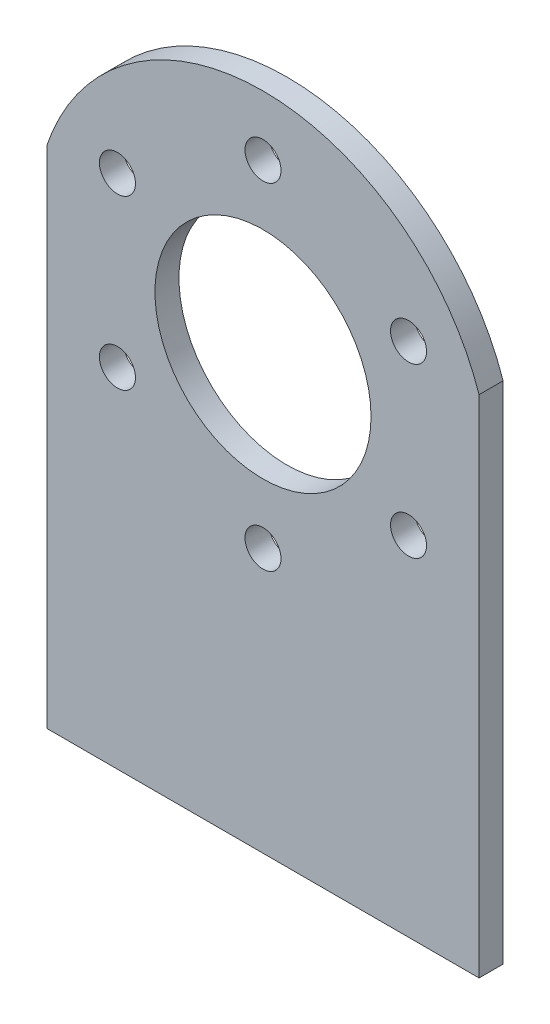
ISO-10303-21;
HEADER;
FILE_DESCRIPTION(('STEP AP214'),'2;1');
FILE_NAME('part.step','',(''),(''),'','','');
FILE_SCHEMA(('AUTOMOTIVE_DESIGN { 1 0 10303 214 1 1 1 1 }'));
ENDSEC;
DATA;
#1=APPLICATION_CONTEXT('core data for automotive mechanical design processes');
#2=APPLICATION_PROTOCOL_DEFINITION('international standard','automotive_design',2000,#1);
#3=PRODUCT_CONTEXT('',#1,'mechanical');
#4=PRODUCT('Part','Part','',(#3));
#5=PRODUCT_RELATED_PRODUCT_CATEGORY('part','',(#4));
#6=PRODUCT_DEFINITION_FORMATION('','',#4);
#7=PRODUCT_DEFINITION_CONTEXT('part definition',#1,'design');
#8=PRODUCT_DEFINITION('design','',#6,#7);
#9=PRODUCT_DEFINITION_SHAPE('','',#8);
#10=(LENGTH_UNIT() NAMED_UNIT(*) SI_UNIT(.MILLI.,.METRE.));
#11=(NAMED_UNIT(*) PLANE_ANGLE_UNIT() SI_UNIT($,.RADIAN.));
#12=(NAMED_UNIT(*) SI_UNIT($,.STERADIAN.) SOLID_ANGLE_UNIT());
#13=UNCERTAINTY_MEASURE_WITH_UNIT(LENGTH_MEASURE(1.E-05),#10,'distance_accuracy_value','');
#14=(GEOMETRIC_REPRESENTATION_CONTEXT(3) GLOBAL_UNCERTAINTY_ASSIGNED_CONTEXT((#13)) GLOBAL_UNIT_ASSIGNED_CONTEXT((#10,
#11,#12)) REPRESENTATION_CONTEXT('',''));
#15=CARTESIAN_POINT('',(0.,0.,0.));
#16=DIRECTION('',(0.,0.,1.));
#17=DIRECTION('',(1.,0.,0.));
#18=AXIS2_PLACEMENT_3D('',#15,#16,#17);
#19=CARTESIAN_POINT('',(-57.15,87.3125,-6.34999999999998));
#20=DIRECTION('',(1.,0.,0.));
#21=DIRECTION('',(0.,0.,-1.));
#22=AXIS2_PLACEMENT_3D('',#19,#20,#21);
#23=PLANE('',#22);
#24=DIRECTION('',(0.,-1.,0.));
#25=VECTOR('',#24,1.);
#26=CARTESIAN_POINT('',(-57.15,87.3125,0.));
#27=LINE('',#26,#25);
#28=CARTESIAN_POINT('',(-57.15,46.3002710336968,0.));
#29=VERTEX_POINT('',#28);
#30=CARTESIAN_POINT('',(-57.15,-87.3125,0.));
#31=VERTEX_POINT('',#30);
#32=EDGE_CURVE('E11',#29,#31,#27,.T.);
#33=ORIENTED_EDGE('',*,*,#32,.F.);
#34=DIRECTION('',(0.,0.,1.));
#35=VECTOR('',#34,1.);
#36=CARTESIAN_POINT('',(-57.15,46.3002710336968,-6.35));
#37=LINE('',#36,#35);
#38=CARTESIAN_POINT('',(-57.15,46.3002710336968,-6.35));
#39=VERTEX_POINT('',#38);
#40=EDGE_CURVE('E74',#39,#29,#37,.T.);
#41=ORIENTED_EDGE('',*,*,#40,.F.);
#42=DIRECTION('',(0.,-1.,0.));
#43=VECTOR('',#42,1.);
#44=CARTESIAN_POINT('',(-57.15,87.3125,-6.34999999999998));
#45=LINE('',#44,#43);
#46=CARTESIAN_POINT('',(-57.15,-87.3125,-6.34999999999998));
#47=VERTEX_POINT('',#46);
#48=EDGE_CURVE('E55',#39,#47,#45,.T.);
#49=ORIENTED_EDGE('',*,*,#48,.T.);
#50=DIRECTION('',(0.,0.,1.));
#51=VECTOR('',#50,1.);
#52=CARTESIAN_POINT('',(-57.15,-87.3125,-6.34999999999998));
#53=LINE('',#52,#51);
#54=EDGE_CURVE('E80',#47,#31,#53,.T.);
#55=ORIENTED_EDGE('',*,*,#54,.T.);
#56=EDGE_LOOP('',(#33,#41,#49,#55));
#57=FACE_BOUND('',#56,.T.);
#58=ADVANCED_FACE('F33',(#57),#23,.F.);
#59=CARTESIAN_POINT('',(-57.15,87.3125,0.));
#60=DIRECTION('',(0.,0.,-1.));
#61=DIRECTION('',(-1.,0.,0.));
#62=AXIS2_PLACEMENT_3D('',#59,#60,#61);
#63=PLANE('',#62);
#64=CARTESIAN_POINT('',(38.4948291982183,49.2125,0.));
#65=DIRECTION('',(0.,0.,1.));
#66=DIRECTION('',(1.,0.,0.));
#67=AXIS2_PLACEMENT_3D('',#64,#65,#66);
#68=CIRCLE('',#67,4.76249999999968);
#69=CARTESIAN_POINT('',(43.257329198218,49.2125,0.));
#70=VERTEX_POINT('',#69);
#71=EDGE_CURVE('E146',#70,#70,#68,.T.);
#72=ORIENTED_EDGE('',*,*,#71,.F.);
#73=EDGE_LOOP('',(#72));
#74=FACE_BOUND('',#73,.T.);
#75=CARTESIAN_POINT('',(38.4948291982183,4.76250000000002,0.));
#76=DIRECTION('',(0.,0.,1.));
#77=DIRECTION('',(1.,0.,0.));
#78=AXIS2_PLACEMENT_3D('',#75,#76,#77);
#79=CIRCLE('',#78,4.76249999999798);
#80=CARTESIAN_POINT('',(43.2573291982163,4.76250000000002,0.));
#81=VERTEX_POINT('',#80);
#82=EDGE_CURVE('E140',#81,#81,#79,.T.);
#83=ORIENTED_EDGE('',*,*,#82,.F.);
#84=EDGE_LOOP('',(#83));
#85=FACE_BOUND('',#84,.T.);
#86=CARTESIAN_POINT('',(0.,-17.4625,0.));
#87=DIRECTION('',(0.,0.,1.));
#88=DIRECTION('',(1.,0.,0.));
#89=AXIS2_PLACEMENT_3D('',#86,#87,#88);
#90=CIRCLE('',#89,4.7624999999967);
#91=CARTESIAN_POINT('',(4.76249999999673,-17.4625,0.));
#92=VERTEX_POINT('',#91);
#93=EDGE_CURVE('E134',#92,#92,#90,.T.);
#94=ORIENTED_EDGE('',*,*,#93,.F.);
#95=EDGE_LOOP('',(#94));
#96=FACE_BOUND('',#95,.T.);
#97=CARTESIAN_POINT('',(-38.4948291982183,4.76249999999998,0.));
#98=DIRECTION('',(0.,0.,1.));
#99=DIRECTION('',(1.,0.,0.));
#100=AXIS2_PLACEMENT_3D('',#97,#98,#99);
#101=CIRCLE('',#100,4.76249999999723);
#102=CARTESIAN_POINT('',(-33.732329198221,4.76249999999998,0.));
#103=VERTEX_POINT('',#102);
#104=EDGE_CURVE('E128',#103,#103,#101,.T.);
#105=ORIENTED_EDGE('',*,*,#104,.F.);
#106=EDGE_LOOP('',(#105));
#107=FACE_BOUND('',#106,.T.);
#108=CARTESIAN_POINT('',(-38.4948291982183,49.2125,0.));
#109=DIRECTION('',(0.,0.,1.));
#110=DIRECTION('',(1.,0.,0.));
#111=AXIS2_PLACEMENT_3D('',#108,#109,#110);
#112=CIRCLE('',#111,4.76249999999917);
#113=CARTESIAN_POINT('',(-33.7323291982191,49.2125,0.));
#114=VERTEX_POINT('',#113);
#115=EDGE_CURVE('E122',#114,#114,#112,.T.);
#116=ORIENTED_EDGE('',*,*,#115,.F.);
#117=EDGE_LOOP('',(#116));
#118=FACE_BOUND('',#117,.T.);
#119=CARTESIAN_POINT('',(0.,71.4375,0.));
#120=DIRECTION('',(0.,0.,1.));
#121=DIRECTION('',(1.,0.,0.));
#122=AXIS2_PLACEMENT_3D('',#119,#120,#121);
#123=CIRCLE('',#122,4.7625);
#124=CARTESIAN_POINT('',(4.76250000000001,71.4375,0.));
#125=VERTEX_POINT('',#124);
#126=EDGE_CURVE('E116',#125,#125,#123,.T.);
#127=ORIENTED_EDGE('',*,*,#126,.F.);
#128=EDGE_LOOP('',(#127));
#129=FACE_BOUND('',#128,.T.);
#130=CARTESIAN_POINT('',(0.,26.9875,0.));
#131=DIRECTION('',(0.,0.,1.));
#132=DIRECTION('',(1.,0.,0.));
#133=AXIS2_PLACEMENT_3D('',#130,#131,#132);
#134=CIRCLE('',#133,28.575);
#135=CARTESIAN_POINT('',(28.575,26.9875,0.));
#136=VERTEX_POINT('',#135);
#137=EDGE_CURVE('E110',#136,#136,#134,.T.);
#138=ORIENTED_EDGE('',*,*,#137,.F.);
#139=EDGE_LOOP('',(#138));
#140=FACE_BOUND('',#139,.T.);
#141=DIRECTION('',(0.,-1.,0.));
#142=VECTOR('',#141,1.);
#143=CARTESIAN_POINT('',(57.15,87.3125,0.));
#144=LINE('',#143,#142);
#145=CARTESIAN_POINT('',(57.15,46.3002710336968,0.));
#146=VERTEX_POINT('',#145);
#147=CARTESIAN_POINT('',(57.15,-87.3125,0.));
#148=VERTEX_POINT('',#147);
#149=EDGE_CURVE('E40',#146,#148,#144,.T.);
#150=ORIENTED_EDGE('',*,*,#149,.F.);
#151=CARTESIAN_POINT('',(0.,26.9875,0.));
#152=DIRECTION('',(0.,0.,-1.));
#153=DIRECTION('',(-1.,0.,0.));
#154=AXIS2_PLACEMENT_3D('',#151,#152,#153);
#155=CIRCLE('',#154,60.325);
#156=EDGE_CURVE('E78',#29,#146,#155,.T.);
#157=ORIENTED_EDGE('',*,*,#156,.F.);
#158=ORIENTED_EDGE('',*,*,#32,.T.);
#159=DIRECTION('',(1.,0.,0.));
#160=VECTOR('',#159,1.);
#161=CARTESIAN_POINT('',(-57.15,-87.3125,0.));
#162=LINE('',#161,#160);
#163=EDGE_CURVE('E100',#31,#148,#162,.T.);
#164=ORIENTED_EDGE('',*,*,#163,.T.);
#165=EDGE_LOOP('',(#150,#157,#158,#164));
#166=FACE_BOUND('',#165,.T.);
#167=ADVANCED_FACE('F101',(#74,#85,#96,#107,#118,#129,#140,#166),#63,.F.);
#168=CARTESIAN_POINT('',(57.15,87.3125,0.));
#169=DIRECTION('',(-1.,0.,0.));
#170=DIRECTION('',(0.,0.,1.));
#171=AXIS2_PLACEMENT_3D('',#168,#169,#170);
#172=PLANE('',#171);
#173=DIRECTION('',(0.,-1.,0.));
#174=VECTOR('',#173,1.);
#175=CARTESIAN_POINT('',(57.15,87.3125,-6.35));
#176=LINE('',#175,#174);
#177=CARTESIAN_POINT('',(57.15,46.3002710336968,-6.35));
#178=VERTEX_POINT('',#177);
#179=CARTESIAN_POINT('',(57.15,-87.3125,-6.35));
#180=VERTEX_POINT('',#179);
#181=EDGE_CURVE('E86',#178,#180,#176,.T.);
#182=ORIENTED_EDGE('',*,*,#181,.F.);
#183=DIRECTION('',(0.,0.,1.));
#184=VECTOR('',#183,1.);
#185=CARTESIAN_POINT('',(57.15,46.3002710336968,-6.35));
#186=LINE('',#185,#184);
#187=EDGE_CURVE('E47',#178,#146,#186,.T.);
#188=ORIENTED_EDGE('',*,*,#187,.T.);
#189=ORIENTED_EDGE('',*,*,#149,.T.);
#190=DIRECTION('',(0.,0.,-1.));
#191=VECTOR('',#190,1.);
#192=CARTESIAN_POINT('',(57.15,-87.3125,0.));
#193=LINE('',#192,#191);
#194=EDGE_CURVE('E89',#148,#180,#193,.T.);
#195=ORIENTED_EDGE('',*,*,#194,.T.);
#196=EDGE_LOOP('',(#182,#188,#189,#195));
#197=FACE_BOUND('',#196,.T.);
#198=ADVANCED_FACE('F96',(#197),#172,.F.);
#199=CARTESIAN_POINT('',(57.15,87.3125,-6.35));
#200=DIRECTION('',(0.,0.,1.));
#201=DIRECTION('',(1.,0.,0.));
#202=AXIS2_PLACEMENT_3D('',#199,#200,#201);
#203=PLANE('',#202);
#204=CARTESIAN_POINT('',(38.4948291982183,49.2125,-6.35));
#205=DIRECTION('',(0.,0.,1.));
#206=DIRECTION('',(1.,0.,0.));
#207=AXIS2_PLACEMENT_3D('',#204,#205,#206);
#208=CIRCLE('',#207,4.76249999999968);
#209=CARTESIAN_POINT('',(43.257329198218,49.2125,-6.35));
#210=VERTEX_POINT('',#209);
#211=EDGE_CURVE('E119',#210,#210,#208,.T.);
#212=ORIENTED_EDGE('',*,*,#211,.T.);
#213=EDGE_LOOP('',(#212));
#214=FACE_BOUND('',#213,.T.);
#215=CARTESIAN_POINT('',(38.4948291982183,4.76250000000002,-6.35));
#216=DIRECTION('',(0.,0.,1.));
#217=DIRECTION('',(1.,0.,0.));
#218=AXIS2_PLACEMENT_3D('',#215,#216,#217);
#219=CIRCLE('',#218,4.76249999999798);
#220=CARTESIAN_POINT('',(43.2573291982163,4.76250000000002,-6.35));
#221=VERTEX_POINT('',#220);
#222=EDGE_CURVE('E143',#221,#221,#219,.T.);
#223=ORIENTED_EDGE('',*,*,#222,.T.);
#224=EDGE_LOOP('',(#223));
#225=FACE_BOUND('',#224,.T.);
#226=CARTESIAN_POINT('',(0.,-17.4625,-6.35));
#227=DIRECTION('',(0.,0.,1.));
#228=DIRECTION('',(1.,0.,0.));
#229=AXIS2_PLACEMENT_3D('',#226,#227,#228);
#230=CIRCLE('',#229,4.7624999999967);
#231=CARTESIAN_POINT('',(4.76249999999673,-17.4625,-6.35));
#232=VERTEX_POINT('',#231);
#233=EDGE_CURVE('E137',#232,#232,#230,.T.);
#234=ORIENTED_EDGE('',*,*,#233,.T.);
#235=EDGE_LOOP('',(#234));
#236=FACE_BOUND('',#235,.T.);
#237=CARTESIAN_POINT('',(-38.4948291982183,4.76249999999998,-6.35));
#238=DIRECTION('',(0.,0.,1.));
#239=DIRECTION('',(1.,0.,0.));
#240=AXIS2_PLACEMENT_3D('',#237,#238,#239);
#241=CIRCLE('',#240,4.76249999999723);
#242=CARTESIAN_POINT('',(-33.732329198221,4.76249999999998,-6.35));
#243=VERTEX_POINT('',#242);
#244=EDGE_CURVE('E131',#243,#243,#241,.T.);
#245=ORIENTED_EDGE('',*,*,#244,.T.);
#246=EDGE_LOOP('',(#245));
#247=FACE_BOUND('',#246,.T.);
#248=CARTESIAN_POINT('',(-38.4948291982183,49.2125,-6.35));
#249=DIRECTION('',(0.,0.,1.));
#250=DIRECTION('',(1.,0.,0.));
#251=AXIS2_PLACEMENT_3D('',#248,#249,#250);
#252=CIRCLE('',#251,4.76249999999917);
#253=CARTESIAN_POINT('',(-33.7323291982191,49.2125,-6.35));
#254=VERTEX_POINT('',#253);
#255=EDGE_CURVE('E125',#254,#254,#252,.T.);
#256=ORIENTED_EDGE('',*,*,#255,.T.);
#257=EDGE_LOOP('',(#256));
#258=FACE_BOUND('',#257,.T.);
#259=CARTESIAN_POINT('',(0.,71.4375,-6.35));
#260=DIRECTION('',(0.,0.,1.));
#261=DIRECTION('',(1.,0.,0.));
#262=AXIS2_PLACEMENT_3D('',#259,#260,#261);
#263=CIRCLE('',#262,4.7625);
#264=CARTESIAN_POINT('',(4.76250000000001,71.4375,-6.35));
#265=VERTEX_POINT('',#264);
#266=EDGE_CURVE('E113',#265,#265,#263,.T.);
#267=ORIENTED_EDGE('',*,*,#266,.T.);
#268=EDGE_LOOP('',(#267));
#269=FACE_BOUND('',#268,.T.);
#270=CARTESIAN_POINT('',(0.,26.9875,-6.35));
#271=DIRECTION('',(0.,0.,1.));
#272=DIRECTION('',(1.,0.,0.));
#273=AXIS2_PLACEMENT_3D('',#270,#271,#272);
#274=CIRCLE('',#273,28.575);
#275=CARTESIAN_POINT('',(28.575,26.9875,-6.35));
#276=VERTEX_POINT('',#275);
#277=EDGE_CURVE('E108',#276,#276,#274,.T.);
#278=ORIENTED_EDGE('',*,*,#277,.T.);
#279=EDGE_LOOP('',(#278));
#280=FACE_BOUND('',#279,.T.);
#281=ORIENTED_EDGE('',*,*,#48,.F.);
#282=CARTESIAN_POINT('',(0.,26.9875,-6.35));
#283=DIRECTION('',(0.,0.,-1.));
#284=DIRECTION('',(-1.,0.,0.));
#285=AXIS2_PLACEMENT_3D('',#282,#283,#284);
#286=CIRCLE('',#285,60.325);
#287=EDGE_CURVE('E72',#39,#178,#286,.T.);
#288=ORIENTED_EDGE('',*,*,#287,.T.);
#289=ORIENTED_EDGE('',*,*,#181,.T.);
#290=DIRECTION('',(-1.,0.,0.));
#291=VECTOR('',#290,1.);
#292=CARTESIAN_POINT('',(57.15,-87.3125,-6.35));
#293=LINE('',#292,#291);
#294=EDGE_CURVE('E84',#180,#47,#293,.T.);
#295=ORIENTED_EDGE('',*,*,#294,.T.);
#296=EDGE_LOOP('',(#281,#288,#289,#295));
#297=FACE_BOUND('',#296,.T.);
#298=ADVANCED_FACE('F82',(#214,#225,#236,#247,#258,#269,#280,#297),#203,.F.);
#299=CARTESIAN_POINT('',(0.,-87.3125,0.));
#300=DIRECTION('',(0.,1.,0.));
#301=DIRECTION('',(0.,0.,1.));
#302=AXIS2_PLACEMENT_3D('',#299,#300,#301);
#303=PLANE('',#302);
#304=ORIENTED_EDGE('',*,*,#54,.F.);
#305=ORIENTED_EDGE('',*,*,#294,.F.);
#306=ORIENTED_EDGE('',*,*,#194,.F.);
#307=ORIENTED_EDGE('',*,*,#163,.F.);
#308=EDGE_LOOP('',(#304,#305,#306,#307));
#309=FACE_BOUND('',#308,.T.);
#310=ADVANCED_FACE('F104',(#309),#303,.F.);
#311=CARTESIAN_POINT('',(0.,26.9875,-6.35));
#312=DIRECTION('',(0.,0.,1.));
#313=DIRECTION('',(1.,0.,0.));
#314=AXIS2_PLACEMENT_3D('',#311,#312,#313);
#315=CYLINDRICAL_SURFACE('',#314,60.325);
#316=ORIENTED_EDGE('',*,*,#156,.T.);
#317=ORIENTED_EDGE('',*,*,#187,.F.);
#318=ORIENTED_EDGE('',*,*,#287,.F.);
#319=ORIENTED_EDGE('',*,*,#40,.T.);
#320=EDGE_LOOP('',(#316,#317,#318,#319));
#321=FACE_BOUND('',#320,.T.);
#322=ADVANCED_FACE('F73',(#321),#315,.T.);
#323=CARTESIAN_POINT('',(0.,26.9875,-6.35));
#324=DIRECTION('',(0.,0.,1.));
#325=DIRECTION('',(1.,0.,0.));
#326=AXIS2_PLACEMENT_3D('',#323,#324,#325);
#327=CYLINDRICAL_SURFACE('',#326,28.575);
#328=ORIENTED_EDGE('',*,*,#277,.F.);
#329=EDGE_LOOP('',(#328));
#330=FACE_BOUND('',#329,.T.);
#331=ORIENTED_EDGE('',*,*,#137,.T.);
#332=EDGE_LOOP('',(#331));
#333=FACE_BOUND('',#332,.T.);
#334=ADVANCED_FACE('F175',(#330,#333),#327,.F.);
#335=CARTESIAN_POINT('',(0.,71.4375,-6.35));
#336=DIRECTION('',(0.,0.,1.));
#337=DIRECTION('',(1.,0.,0.));
#338=AXIS2_PLACEMENT_3D('',#335,#336,#337);
#339=CYLINDRICAL_SURFACE('',#338,4.7625);
#340=ORIENTED_EDGE('',*,*,#266,.F.);
#341=EDGE_LOOP('',(#340));
#342=FACE_BOUND('',#341,.T.);
#343=ORIENTED_EDGE('',*,*,#126,.T.);
#344=EDGE_LOOP('',(#343));
#345=FACE_BOUND('',#344,.T.);
#346=ADVANCED_FACE('F177',(#342,#345),#339,.F.);
#347=CARTESIAN_POINT('',(-38.4948291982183,49.2125,-6.35));
#348=DIRECTION('',(0.,0.,1.));
#349=DIRECTION('',(1.,0.,0.));
#350=AXIS2_PLACEMENT_3D('',#347,#348,#349);
#351=CYLINDRICAL_SURFACE('',#350,4.76249999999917);
#352=ORIENTED_EDGE('',*,*,#255,.F.);
#353=EDGE_LOOP('',(#352));
#354=FACE_BOUND('',#353,.T.);
#355=ORIENTED_EDGE('',*,*,#115,.T.);
#356=EDGE_LOOP('',(#355));
#357=FACE_BOUND('',#356,.T.);
#358=ADVANCED_FACE('F184',(#354,#357),#351,.F.);
#359=CARTESIAN_POINT('',(-38.4948291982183,4.76249999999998,-6.35));
#360=DIRECTION('',(0.,0.,1.));
#361=DIRECTION('',(1.,0.,0.));
#362=AXIS2_PLACEMENT_3D('',#359,#360,#361);
#363=CYLINDRICAL_SURFACE('',#362,4.76249999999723);
#364=ORIENTED_EDGE('',*,*,#244,.F.);
#365=EDGE_LOOP('',(#364));
#366=FACE_BOUND('',#365,.T.);
#367=ORIENTED_EDGE('',*,*,#104,.T.);
#368=EDGE_LOOP('',(#367));
#369=FACE_BOUND('',#368,.T.);
#370=ADVANCED_FACE('F237',(#366,#369),#363,.F.);
#371=CARTESIAN_POINT('',(0.,-17.4625,-6.35));
#372=DIRECTION('',(0.,0.,1.));
#373=DIRECTION('',(1.,0.,0.));
#374=AXIS2_PLACEMENT_3D('',#371,#372,#373);
#375=CYLINDRICAL_SURFACE('',#374,4.7624999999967);
#376=ORIENTED_EDGE('',*,*,#233,.F.);
#377=EDGE_LOOP('',(#376));
#378=FACE_BOUND('',#377,.T.);
#379=ORIENTED_EDGE('',*,*,#93,.T.);
#380=EDGE_LOOP('',(#379));
#381=FACE_BOUND('',#380,.T.);
#382=ADVANCED_FACE('F246',(#378,#381),#375,.F.);
#383=CARTESIAN_POINT('',(38.4948291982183,4.76250000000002,-6.35));
#384=DIRECTION('',(0.,0.,1.));
#385=DIRECTION('',(1.,0.,0.));
#386=AXIS2_PLACEMENT_3D('',#383,#384,#385);
#387=CYLINDRICAL_SURFACE('',#386,4.76249999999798);
#388=ORIENTED_EDGE('',*,*,#222,.F.);
#389=EDGE_LOOP('',(#388));
#390=FACE_BOUND('',#389,.T.);
#391=ORIENTED_EDGE('',*,*,#82,.T.);
#392=EDGE_LOOP('',(#391));
#393=FACE_BOUND('',#392,.T.);
#394=ADVANCED_FACE('F157',(#390,#393),#387,.F.);
#395=CARTESIAN_POINT('',(38.4948291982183,49.2125,-6.35));
#396=DIRECTION('',(0.,0.,1.));
#397=DIRECTION('',(1.,0.,0.));
#398=AXIS2_PLACEMENT_3D('',#395,#396,#397);
#399=CYLINDRICAL_SURFACE('',#398,4.76249999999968);
#400=ORIENTED_EDGE('',*,*,#211,.F.);
#401=EDGE_LOOP('',(#400));
#402=FACE_BOUND('',#401,.T.);
#403=ORIENTED_EDGE('',*,*,#71,.T.);
#404=EDGE_LOOP('',(#403));
#405=FACE_BOUND('',#404,.T.);
#406=ADVANCED_FACE('F154',(#402,#405),#399,.F.);
#407=CLOSED_SHELL('',(#58,#167,#198,#298,#310,#322,#334,#346,#358,#370,#382,#394,#406));
#408=MANIFOLD_SOLID_BREP('B2',#407);
#409=ADVANCED_BREP_SHAPE_REPRESENTATION('',(#18,#408),#14);
#410=SHAPE_DEFINITION_REPRESENTATION(#9,#409);
ENDSEC;
END-ISO-10303-21;
